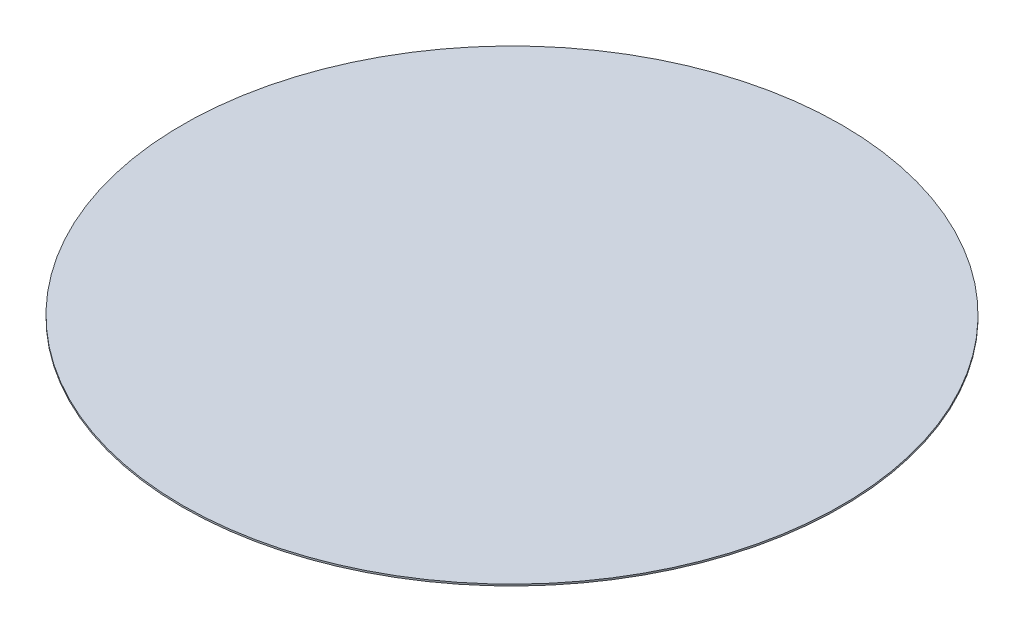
from build123d import *

# Parameters (mm, degrees)
SKETCH1_R           = 70
BOSS_EXTRUDE1_DEPTH = 0.35


with BuildPart() as part:
    # Sketch1 → Boss-Extrude1 (new body)
    with BuildSketch(Plane(origin=(0, 0, 0), x_dir=(1, 0, 0), z_dir=(0, 1, 0))):
        with Locations(Location((0, 0, 0), (0, 0, 270))):
            Circle(SKETCH1_R)
    extrude(amount=BOSS_EXTRUDE1_DEPTH)


solid = part.part
